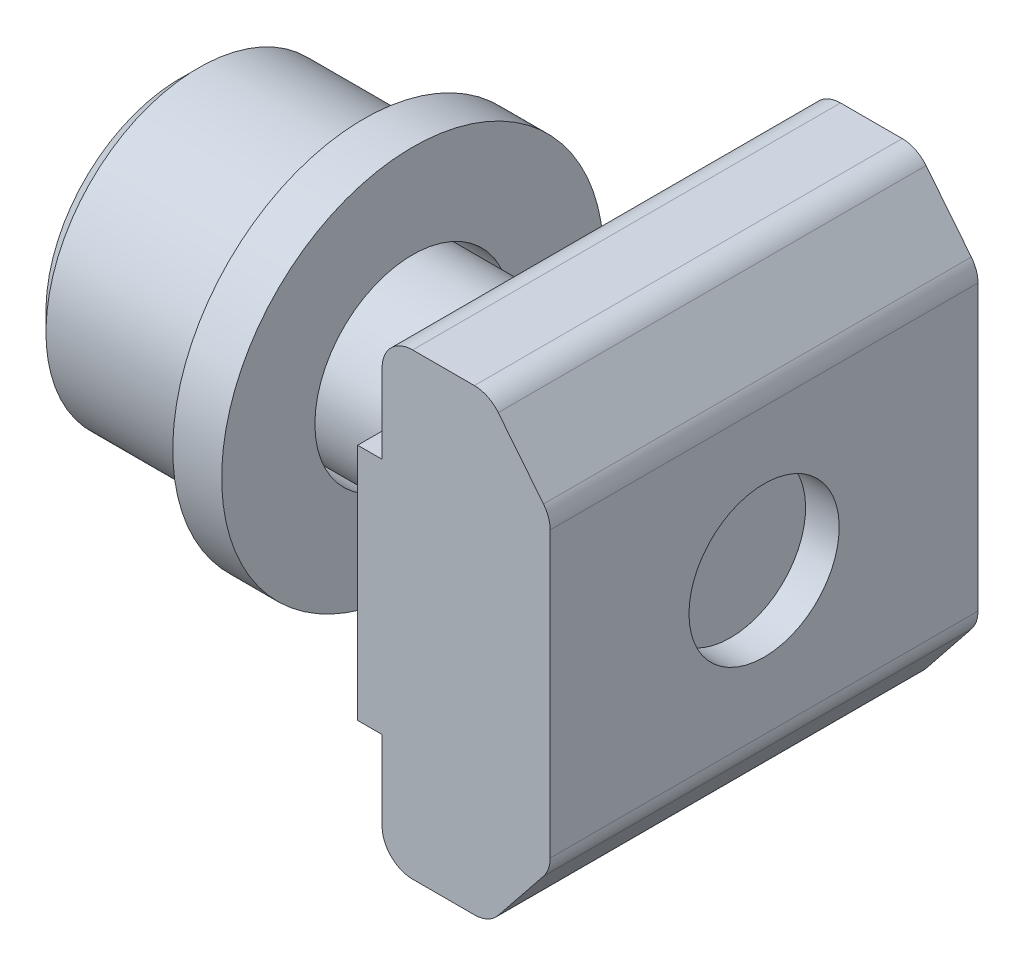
ISO-10303-21;
HEADER;
FILE_DESCRIPTION(('STEP AP214'),'2;1');
FILE_NAME('part.step','',(''),(''),'','','');
FILE_SCHEMA(('AUTOMOTIVE_DESIGN { 1 0 10303 214 1 1 1 1 }'));
ENDSEC;
DATA;
#1=APPLICATION_CONTEXT('core data for automotive mechanical design processes');
#2=APPLICATION_PROTOCOL_DEFINITION('international standard','automotive_design',2000,#1);
#3=PRODUCT_CONTEXT('',#1,'mechanical');
#4=PRODUCT('Part','Part','',(#3));
#5=PRODUCT_RELATED_PRODUCT_CATEGORY('part','',(#4));
#6=PRODUCT_DEFINITION_FORMATION('','',#4);
#7=PRODUCT_DEFINITION_CONTEXT('part definition',#1,'design');
#8=PRODUCT_DEFINITION('design','',#6,#7);
#9=PRODUCT_DEFINITION_SHAPE('','',#8);
#10=(LENGTH_UNIT() NAMED_UNIT(*) SI_UNIT(.MILLI.,.METRE.));
#11=(NAMED_UNIT(*) PLANE_ANGLE_UNIT() SI_UNIT($,.RADIAN.));
#12=(NAMED_UNIT(*) SI_UNIT($,.STERADIAN.) SOLID_ANGLE_UNIT());
#13=UNCERTAINTY_MEASURE_WITH_UNIT(LENGTH_MEASURE(1.E-05),#10,'distance_accuracy_value','');
#14=(GEOMETRIC_REPRESENTATION_CONTEXT(3) GLOBAL_UNCERTAINTY_ASSIGNED_CONTEXT((#13)) GLOBAL_UNIT_ASSIGNED_CONTEXT((#10,
#11,#12)) REPRESENTATION_CONTEXT('',''));
#15=CARTESIAN_POINT('',(0.,0.,0.));
#16=DIRECTION('',(0.,0.,1.));
#17=DIRECTION('',(1.,0.,0.));
#18=AXIS2_PLACEMENT_3D('',#15,#16,#17);
#19=CARTESIAN_POINT('',(10.5,-4.64921894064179,7.));
#20=DIRECTION('',(0.,0.,-1.));
#21=DIRECTION('',(-1.,0.,0.));
#22=AXIS2_PLACEMENT_3D('',#19,#20,#21);
#23=CYLINDRICAL_SURFACE('',#22,1.);
#24=CARTESIAN_POINT('',(10.5,-4.64921894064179,-7.));
#25=DIRECTION('',(0.,0.,1.));
#26=DIRECTION('',(1.,0.,0.));
#27=AXIS2_PLACEMENT_3D('',#24,#25,#26);
#28=CIRCLE('',#27,1.);
#29=CARTESIAN_POINT('',(11.280868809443,-5.27391398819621,-7.));
#30=VERTEX_POINT('',#29);
#31=CARTESIAN_POINT('',(11.5,-4.64921894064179,-7.));
#32=VERTEX_POINT('',#31);
#33=EDGE_CURVE('E189',#30,#32,#28,.T.);
#34=ORIENTED_EDGE('',*,*,#33,.T.);
#35=DIRECTION('',(0.,0.,-1.));
#36=VECTOR('',#35,1.);
#37=CARTESIAN_POINT('',(11.5,-4.64921894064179,7.));
#38=LINE('',#37,#36);
#39=CARTESIAN_POINT('',(11.5,-4.64921894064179,7.));
#40=VERTEX_POINT('',#39);
#41=EDGE_CURVE('E12',#40,#32,#38,.T.);
#42=ORIENTED_EDGE('',*,*,#41,.F.);
#43=CARTESIAN_POINT('',(10.5,-4.64921894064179,7.));
#44=DIRECTION('',(0.,0.,1.));
#45=DIRECTION('',(1.,0.,0.));
#46=AXIS2_PLACEMENT_3D('',#43,#44,#45);
#47=CIRCLE('',#46,1.);
#48=CARTESIAN_POINT('',(11.280868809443,-5.27391398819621,7.));
#49=VERTEX_POINT('',#48);
#50=EDGE_CURVE('E220',#49,#40,#47,.T.);
#51=ORIENTED_EDGE('',*,*,#50,.F.);
#52=DIRECTION('',(0.,0.,-1.));
#53=VECTOR('',#52,1.);
#54=CARTESIAN_POINT('',(11.280868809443,-5.27391398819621,7.));
#55=LINE('',#54,#53);
#56=EDGE_CURVE('E185',#49,#30,#55,.T.);
#57=ORIENTED_EDGE('',*,*,#56,.T.);
#58=EDGE_LOOP('',(#34,#42,#51,#57));
#59=FACE_BOUND('',#58,.T.);
#60=ADVANCED_FACE('F45',(#59),#23,.T.);
#61=CARTESIAN_POINT('',(11.5,-4.64921894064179,7.));
#62=DIRECTION('',(-1.,0.,0.));
#63=DIRECTION('',(0.,-1.,0.));
#64=AXIS2_PLACEMENT_3D('',#61,#62,#63);
#65=PLANE('',#64);
#66=CARTESIAN_POINT('',(11.5,0.,0.));
#67=DIRECTION('',(-1.,0.,0.));
#68=DIRECTION('',(0.,-1.,0.));
#69=AXIS2_PLACEMENT_3D('',#66,#67,#68);
#70=CIRCLE('',#69,2.4585);
#71=CARTESIAN_POINT('',(11.5,-2.4585,0.));
#72=VERTEX_POINT('',#71);
#73=EDGE_CURVE('E193',#72,#72,#70,.T.);
#74=ORIENTED_EDGE('',*,*,#73,.T.);
#75=EDGE_LOOP('',(#74));
#76=FACE_BOUND('',#75,.T.);
#77=DIRECTION('',(0.,1.,0.));
#78=VECTOR('',#77,1.);
#79=CARTESIAN_POINT('',(11.5,-4.64921894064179,-7.));
#80=LINE('',#79,#78);
#81=CARTESIAN_POINT('',(11.5,4.64921894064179,-7.));
#82=VERTEX_POINT('',#81);
#83=EDGE_CURVE('E192',#32,#82,#80,.T.);
#84=ORIENTED_EDGE('',*,*,#83,.T.);
#85=DIRECTION('',(0.,0.,-1.));
#86=VECTOR('',#85,1.);
#87=CARTESIAN_POINT('',(11.5,4.64921894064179,7.));
#88=LINE('',#87,#86);
#89=CARTESIAN_POINT('',(11.5,4.64921894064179,7.));
#90=VERTEX_POINT('',#89);
#91=EDGE_CURVE('E53',#90,#82,#88,.T.);
#92=ORIENTED_EDGE('',*,*,#91,.F.);
#93=DIRECTION('',(0.,1.,0.));
#94=VECTOR('',#93,1.);
#95=CARTESIAN_POINT('',(11.5,-4.64921894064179,7.));
#96=LINE('',#95,#94);
#97=EDGE_CURVE('E128',#40,#90,#96,.T.);
#98=ORIENTED_EDGE('',*,*,#97,.F.);
#99=ORIENTED_EDGE('',*,*,#41,.T.);
#100=EDGE_LOOP('',(#84,#92,#98,#99));
#101=FACE_BOUND('',#100,.T.);
#102=ADVANCED_FACE('F318',(#76,#101),#65,.F.);
#103=CARTESIAN_POINT('',(10.5,4.64921894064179,7.));
#104=DIRECTION('',(0.,0.,-1.));
#105=DIRECTION('',(-1.,0.,0.));
#106=AXIS2_PLACEMENT_3D('',#103,#104,#105);
#107=CYLINDRICAL_SURFACE('',#106,1.);
#108=CARTESIAN_POINT('',(10.5,4.64921894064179,-7.));
#109=DIRECTION('',(0.,0.,1.));
#110=DIRECTION('',(1.,0.,0.));
#111=AXIS2_PLACEMENT_3D('',#108,#109,#110);
#112=CIRCLE('',#111,1.);
#113=CARTESIAN_POINT('',(11.280868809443,5.27391398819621,-7.));
#114=VERTEX_POINT('',#113);
#115=EDGE_CURVE('E195',#82,#114,#112,.T.);
#116=ORIENTED_EDGE('',*,*,#115,.T.);
#117=DIRECTION('',(0.,0.,-1.));
#118=VECTOR('',#117,1.);
#119=CARTESIAN_POINT('',(11.280868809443,5.27391398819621,7.));
#120=LINE('',#119,#118);
#121=CARTESIAN_POINT('',(11.280868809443,5.27391398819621,7.));
#122=VERTEX_POINT('',#121);
#123=EDGE_CURVE('E251',#122,#114,#120,.T.);
#124=ORIENTED_EDGE('',*,*,#123,.F.);
#125=CARTESIAN_POINT('',(10.5,4.64921894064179,7.));
#126=DIRECTION('',(0.,0.,1.));
#127=DIRECTION('',(1.,0.,0.));
#128=AXIS2_PLACEMENT_3D('',#125,#126,#127);
#129=CIRCLE('',#128,1.);
#130=EDGE_CURVE('E259',#90,#122,#129,.T.);
#131=ORIENTED_EDGE('',*,*,#130,.F.);
#132=ORIENTED_EDGE('',*,*,#91,.T.);
#133=EDGE_LOOP('',(#116,#124,#131,#132));
#134=FACE_BOUND('',#133,.T.);
#135=ADVANCED_FACE('F257',(#134),#107,.T.);
#136=CARTESIAN_POINT('',(11.280868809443,5.27391398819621,7.));
#137=DIRECTION('',(-0.780868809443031,-0.624695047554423,0.));
#138=DIRECTION('',(0.624695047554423,-0.780868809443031,0.));
#139=AXIS2_PLACEMENT_3D('',#136,#137,#138);
#140=PLANE('',#139);
#141=DIRECTION('',(-0.624695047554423,0.780868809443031,0.));
#142=VECTOR('',#141,1.);
#143=CARTESIAN_POINT('',(11.280868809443,5.27391398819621,-7.));
#144=LINE('',#143,#142);
#145=CARTESIAN_POINT('',(9.80024396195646,7.12469504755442,-7.));
#146=VERTEX_POINT('',#145);
#147=EDGE_CURVE('E197',#114,#146,#144,.T.);
#148=ORIENTED_EDGE('',*,*,#147,.T.);
#149=DIRECTION('',(0.,0.,-1.));
#150=VECTOR('',#149,1.);
#151=CARTESIAN_POINT('',(9.80024396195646,7.12469504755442,7.));
#152=LINE('',#151,#150);
#153=CARTESIAN_POINT('',(9.80024396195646,7.12469504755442,7.));
#154=VERTEX_POINT('',#153);
#155=EDGE_CURVE('E248',#154,#146,#152,.T.);
#156=ORIENTED_EDGE('',*,*,#155,.F.);
#157=DIRECTION('',(-0.624695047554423,0.780868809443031,0.));
#158=VECTOR('',#157,1.);
#159=CARTESIAN_POINT('',(11.280868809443,5.27391398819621,7.));
#160=LINE('',#159,#158);
#161=EDGE_CURVE('E277',#122,#154,#160,.T.);
#162=ORIENTED_EDGE('',*,*,#161,.F.);
#163=ORIENTED_EDGE('',*,*,#123,.T.);
#164=EDGE_LOOP('',(#148,#156,#162,#163));
#165=FACE_BOUND('',#164,.T.);
#166=ADVANCED_FACE('F268',(#165),#140,.F.);
#167=CARTESIAN_POINT('',(9.01937515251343,6.5,7.));
#168=DIRECTION('',(0.,0.,-1.));
#169=DIRECTION('',(-1.,0.,0.));
#170=AXIS2_PLACEMENT_3D('',#167,#168,#169);
#171=CYLINDRICAL_SURFACE('',#170,1.);
#172=CARTESIAN_POINT('',(9.01937515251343,6.5,-7.));
#173=DIRECTION('',(0.,0.,1.));
#174=DIRECTION('',(1.,0.,0.));
#175=AXIS2_PLACEMENT_3D('',#172,#173,#174);
#176=CIRCLE('',#175,1.);
#177=CARTESIAN_POINT('',(9.01937515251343,7.5,-7.));
#178=VERTEX_POINT('',#177);
#179=EDGE_CURVE('E199',#146,#178,#176,.T.);
#180=ORIENTED_EDGE('',*,*,#179,.T.);
#181=DIRECTION('',(0.,0.,-1.));
#182=VECTOR('',#181,1.);
#183=CARTESIAN_POINT('',(9.01937515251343,7.5,7.));
#184=LINE('',#183,#182);
#185=CARTESIAN_POINT('',(9.01937515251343,7.5,7.));
#186=VERTEX_POINT('',#185);
#187=EDGE_CURVE('E245',#186,#178,#184,.T.);
#188=ORIENTED_EDGE('',*,*,#187,.F.);
#189=CARTESIAN_POINT('',(9.01937515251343,6.5,7.));
#190=DIRECTION('',(0.,0.,1.));
#191=DIRECTION('',(1.,0.,0.));
#192=AXIS2_PLACEMENT_3D('',#189,#190,#191);
#193=CIRCLE('',#192,1.);
#194=EDGE_CURVE('E274',#154,#186,#193,.T.);
#195=ORIENTED_EDGE('',*,*,#194,.F.);
#196=ORIENTED_EDGE('',*,*,#155,.T.);
#197=EDGE_LOOP('',(#180,#188,#195,#196));
#198=FACE_BOUND('',#197,.T.);
#199=ADVANCED_FACE('F272',(#198),#171,.T.);
#200=CARTESIAN_POINT('',(9.01937515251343,7.5,7.));
#201=DIRECTION('',(0.,-1.,0.));
#202=DIRECTION('',(0.,0.,-1.));
#203=AXIS2_PLACEMENT_3D('',#200,#201,#202);
#204=PLANE('',#203);
#205=DIRECTION('',(-1.,0.,0.));
#206=VECTOR('',#205,1.);
#207=CARTESIAN_POINT('',(9.01937515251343,7.5,-7.));
#208=LINE('',#207,#206);
#209=CARTESIAN_POINT('',(7.,7.5,-7.));
#210=VERTEX_POINT('',#209);
#211=EDGE_CURVE('E201',#178,#210,#208,.T.);
#212=ORIENTED_EDGE('',*,*,#211,.T.);
#213=DIRECTION('',(0.,0.,-1.));
#214=VECTOR('',#213,1.);
#215=CARTESIAN_POINT('',(7.,7.5,7.));
#216=LINE('',#215,#214);
#217=CARTESIAN_POINT('',(7.,7.5,7.));
#218=VERTEX_POINT('',#217);
#219=EDGE_CURVE('E242',#218,#210,#216,.T.);
#220=ORIENTED_EDGE('',*,*,#219,.F.);
#221=DIRECTION('',(-1.,0.,0.));
#222=VECTOR('',#221,1.);
#223=CARTESIAN_POINT('',(9.01937515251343,7.5,7.));
#224=LINE('',#223,#222);
#225=EDGE_CURVE('E276',#186,#218,#224,.T.);
#226=ORIENTED_EDGE('',*,*,#225,.F.);
#227=ORIENTED_EDGE('',*,*,#187,.T.);
#228=EDGE_LOOP('',(#212,#220,#226,#227));
#229=FACE_BOUND('',#228,.T.);
#230=ADVANCED_FACE('F333',(#229),#204,.F.);
#231=CARTESIAN_POINT('',(7.,6.5,7.));
#232=DIRECTION('',(0.,0.,-1.));
#233=DIRECTION('',(-1.,0.,0.));
#234=AXIS2_PLACEMENT_3D('',#231,#232,#233);
#235=CYLINDRICAL_SURFACE('',#234,1.);
#236=CARTESIAN_POINT('',(7.,6.5,-7.));
#237=DIRECTION('',(0.,0.,1.));
#238=DIRECTION('',(1.,0.,0.));
#239=AXIS2_PLACEMENT_3D('',#236,#237,#238);
#240=CIRCLE('',#239,1.);
#241=CARTESIAN_POINT('',(6.,6.5,-7.));
#242=VERTEX_POINT('',#241);
#243=EDGE_CURVE('E203',#210,#242,#240,.T.);
#244=ORIENTED_EDGE('',*,*,#243,.T.);
#245=DIRECTION('',(0.,0.,-1.));
#246=VECTOR('',#245,1.);
#247=CARTESIAN_POINT('',(6.,6.5,7.));
#248=LINE('',#247,#246);
#249=CARTESIAN_POINT('',(6.,6.5,7.));
#250=VERTEX_POINT('',#249);
#251=EDGE_CURVE('E239',#250,#242,#248,.T.);
#252=ORIENTED_EDGE('',*,*,#251,.F.);
#253=CARTESIAN_POINT('',(7.,6.5,7.));
#254=DIRECTION('',(0.,0.,1.));
#255=DIRECTION('',(1.,0.,0.));
#256=AXIS2_PLACEMENT_3D('',#253,#254,#255);
#257=CIRCLE('',#256,1.);
#258=EDGE_CURVE('E279',#218,#250,#257,.T.);
#259=ORIENTED_EDGE('',*,*,#258,.F.);
#260=ORIENTED_EDGE('',*,*,#219,.T.);
#261=EDGE_LOOP('',(#244,#252,#259,#260));
#262=FACE_BOUND('',#261,.T.);
#263=ADVANCED_FACE('F336',(#262),#235,.T.);
#264=CARTESIAN_POINT('',(6.,6.5,7.));
#265=DIRECTION('',(1.,0.,0.));
#266=DIRECTION('',(0.,1.,0.));
#267=AXIS2_PLACEMENT_3D('',#264,#265,#266);
#268=PLANE('',#267);
#269=DIRECTION('',(0.,-1.,0.));
#270=VECTOR('',#269,1.);
#271=CARTESIAN_POINT('',(6.,6.5,-7.));
#272=LINE('',#271,#270);
#273=CARTESIAN_POINT('',(6.,3.9,-7.));
#274=VERTEX_POINT('',#273);
#275=EDGE_CURVE('E205',#242,#274,#272,.T.);
#276=ORIENTED_EDGE('',*,*,#275,.T.);
#277=DIRECTION('',(0.,0.,-1.));
#278=VECTOR('',#277,1.);
#279=CARTESIAN_POINT('',(6.,3.9,7.));
#280=LINE('',#279,#278);
#281=CARTESIAN_POINT('',(6.,3.9,7.));
#282=VERTEX_POINT('',#281);
#283=EDGE_CURVE('E236',#282,#274,#280,.T.);
#284=ORIENTED_EDGE('',*,*,#283,.F.);
#285=DIRECTION('',(0.,-1.,0.));
#286=VECTOR('',#285,1.);
#287=CARTESIAN_POINT('',(6.,6.5,7.));
#288=LINE('',#287,#286);
#289=EDGE_CURVE('E285',#250,#282,#288,.T.);
#290=ORIENTED_EDGE('',*,*,#289,.F.);
#291=ORIENTED_EDGE('',*,*,#251,.T.);
#292=EDGE_LOOP('',(#276,#284,#290,#291));
#293=FACE_BOUND('',#292,.T.);
#294=ADVANCED_FACE('F340',(#293),#268,.F.);
#295=CARTESIAN_POINT('',(6.,3.9,7.));
#296=DIRECTION('',(0.,-1.,0.));
#297=DIRECTION('',(1.,0.,0.));
#298=AXIS2_PLACEMENT_3D('',#295,#296,#297);
#299=PLANE('',#298);
#300=DIRECTION('',(-1.,0.,0.));
#301=VECTOR('',#300,1.);
#302=CARTESIAN_POINT('',(6.,3.9,-7.));
#303=LINE('',#302,#301);
#304=CARTESIAN_POINT('',(5.2,3.9,-7.));
#305=VERTEX_POINT('',#304);
#306=EDGE_CURVE('E207',#274,#305,#303,.T.);
#307=ORIENTED_EDGE('',*,*,#306,.T.);
#308=DIRECTION('',(0.,0.,-1.));
#309=VECTOR('',#308,1.);
#310=CARTESIAN_POINT('',(5.2,3.9,7.));
#311=LINE('',#310,#309);
#312=CARTESIAN_POINT('',(5.2,3.9,7.));
#313=VERTEX_POINT('',#312);
#314=EDGE_CURVE('E233',#313,#305,#311,.T.);
#315=ORIENTED_EDGE('',*,*,#314,.F.);
#316=DIRECTION('',(-1.,0.,0.));
#317=VECTOR('',#316,1.);
#318=CARTESIAN_POINT('',(6.,3.9,7.));
#319=LINE('',#318,#317);
#320=EDGE_CURVE('E287',#282,#313,#319,.T.);
#321=ORIENTED_EDGE('',*,*,#320,.F.);
#322=ORIENTED_EDGE('',*,*,#283,.T.);
#323=EDGE_LOOP('',(#307,#315,#321,#322));
#324=FACE_BOUND('',#323,.T.);
#325=ADVANCED_FACE('F344',(#324),#299,.F.);
#326=CARTESIAN_POINT('',(5.2,3.9,7.));
#327=DIRECTION('',(1.,0.,0.));
#328=DIRECTION('',(0.,1.,0.));
#329=AXIS2_PLACEMENT_3D('',#326,#327,#328);
#330=PLANE('',#329);
#331=CARTESIAN_POINT('',(5.2,0.,0.));
#332=DIRECTION('',(-1.,0.,0.));
#333=DIRECTION('',(0.,0.,1.));
#334=AXIS2_PLACEMENT_3D('',#331,#332,#333);
#335=CIRCLE('',#334,2.4585);
#336=CARTESIAN_POINT('',(5.2,0.,2.4585));
#337=VERTEX_POINT('',#336);
#338=EDGE_CURVE('E434',#337,#337,#335,.T.);
#339=ORIENTED_EDGE('',*,*,#338,.F.);
#340=EDGE_LOOP('',(#339));
#341=FACE_BOUND('',#340,.T.);
#342=DIRECTION('',(0.,-1.,0.));
#343=VECTOR('',#342,1.);
#344=CARTESIAN_POINT('',(5.2,3.9,-7.));
#345=LINE('',#344,#343);
#346=CARTESIAN_POINT('',(5.2,-3.9,-7.));
#347=VERTEX_POINT('',#346);
#348=EDGE_CURVE('E209',#305,#347,#345,.T.);
#349=ORIENTED_EDGE('',*,*,#348,.T.);
#350=DIRECTION('',(0.,0.,-1.));
#351=VECTOR('',#350,1.);
#352=CARTESIAN_POINT('',(5.2,-3.9,7.));
#353=LINE('',#352,#351);
#354=CARTESIAN_POINT('',(5.2,-3.9,7.));
#355=VERTEX_POINT('',#354);
#356=EDGE_CURVE('E230',#355,#347,#353,.T.);
#357=ORIENTED_EDGE('',*,*,#356,.F.);
#358=DIRECTION('',(0.,-1.,0.));
#359=VECTOR('',#358,1.);
#360=CARTESIAN_POINT('',(5.2,3.9,7.));
#361=LINE('',#360,#359);
#362=EDGE_CURVE('E289',#313,#355,#361,.T.);
#363=ORIENTED_EDGE('',*,*,#362,.F.);
#364=ORIENTED_EDGE('',*,*,#314,.T.);
#365=EDGE_LOOP('',(#349,#357,#363,#364));
#366=FACE_BOUND('',#365,.T.);
#367=ADVANCED_FACE('F348',(#341,#366),#330,.F.);
#368=CARTESIAN_POINT('',(5.2,-3.9,7.));
#369=DIRECTION('',(0.,1.,0.));
#370=DIRECTION('',(-1.,0.,0.));
#371=AXIS2_PLACEMENT_3D('',#368,#369,#370);
#372=PLANE('',#371);
#373=DIRECTION('',(1.,0.,0.));
#374=VECTOR('',#373,1.);
#375=CARTESIAN_POINT('',(5.2,-3.9,-7.));
#376=LINE('',#375,#374);
#377=CARTESIAN_POINT('',(6.,-3.9,-7.));
#378=VERTEX_POINT('',#377);
#379=EDGE_CURVE('E211',#347,#378,#376,.T.);
#380=ORIENTED_EDGE('',*,*,#379,.T.);
#381=DIRECTION('',(0.,0.,-1.));
#382=VECTOR('',#381,1.);
#383=CARTESIAN_POINT('',(6.,-3.9,7.));
#384=LINE('',#383,#382);
#385=CARTESIAN_POINT('',(6.,-3.9,7.));
#386=VERTEX_POINT('',#385);
#387=EDGE_CURVE('E227',#386,#378,#384,.T.);
#388=ORIENTED_EDGE('',*,*,#387,.F.);
#389=DIRECTION('',(1.,0.,0.));
#390=VECTOR('',#389,1.);
#391=CARTESIAN_POINT('',(5.2,-3.9,7.));
#392=LINE('',#391,#390);
#393=EDGE_CURVE('E291',#355,#386,#392,.T.);
#394=ORIENTED_EDGE('',*,*,#393,.F.);
#395=ORIENTED_EDGE('',*,*,#356,.T.);
#396=EDGE_LOOP('',(#380,#388,#394,#395));
#397=FACE_BOUND('',#396,.T.);
#398=ADVANCED_FACE('F352',(#397),#372,.F.);
#399=CARTESIAN_POINT('',(6.,-3.9,7.));
#400=DIRECTION('',(1.,0.,0.));
#401=DIRECTION('',(0.,0.,-1.));
#402=AXIS2_PLACEMENT_3D('',#399,#400,#401);
#403=PLANE('',#402);
#404=DIRECTION('',(0.,-1.,0.));
#405=VECTOR('',#404,1.);
#406=CARTESIAN_POINT('',(6.,-3.9,-7.));
#407=LINE('',#406,#405);
#408=CARTESIAN_POINT('',(6.,-6.5,-7.));
#409=VERTEX_POINT('',#408);
#410=EDGE_CURVE('E213',#378,#409,#407,.T.);
#411=ORIENTED_EDGE('',*,*,#410,.T.);
#412=DIRECTION('',(0.,0.,-1.));
#413=VECTOR('',#412,1.);
#414=CARTESIAN_POINT('',(6.,-6.5,7.));
#415=LINE('',#414,#413);
#416=CARTESIAN_POINT('',(6.,-6.5,7.));
#417=VERTEX_POINT('',#416);
#418=EDGE_CURVE('E224',#417,#409,#415,.T.);
#419=ORIENTED_EDGE('',*,*,#418,.F.);
#420=DIRECTION('',(0.,-1.,0.));
#421=VECTOR('',#420,1.);
#422=CARTESIAN_POINT('',(6.,-3.9,7.));
#423=LINE('',#422,#421);
#424=EDGE_CURVE('E293',#386,#417,#423,.T.);
#425=ORIENTED_EDGE('',*,*,#424,.F.);
#426=ORIENTED_EDGE('',*,*,#387,.T.);
#427=EDGE_LOOP('',(#411,#419,#425,#426));
#428=FACE_BOUND('',#427,.T.);
#429=ADVANCED_FACE('F299',(#428),#403,.F.);
#430=CARTESIAN_POINT('',(7.,-6.5,7.));
#431=DIRECTION('',(0.,0.,-1.));
#432=DIRECTION('',(-1.,0.,0.));
#433=AXIS2_PLACEMENT_3D('',#430,#431,#432);
#434=CYLINDRICAL_SURFACE('',#433,1.);
#435=CARTESIAN_POINT('',(7.,-6.5,-7.));
#436=DIRECTION('',(0.,0.,1.));
#437=DIRECTION('',(1.,0.,0.));
#438=AXIS2_PLACEMENT_3D('',#435,#436,#437);
#439=CIRCLE('',#438,1.);
#440=CARTESIAN_POINT('',(7.,-7.5,-7.));
#441=VERTEX_POINT('',#440);
#442=EDGE_CURVE('E215',#409,#441,#439,.T.);
#443=ORIENTED_EDGE('',*,*,#442,.T.);
#444=DIRECTION('',(0.,0.,-1.));
#445=VECTOR('',#444,1.);
#446=CARTESIAN_POINT('',(7.,-7.5,7.));
#447=LINE('',#446,#445);
#448=CARTESIAN_POINT('',(7.,-7.5,7.));
#449=VERTEX_POINT('',#448);
#450=EDGE_CURVE('E180',#449,#441,#447,.T.);
#451=ORIENTED_EDGE('',*,*,#450,.F.);
#452=CARTESIAN_POINT('',(7.,-6.5,7.));
#453=DIRECTION('',(0.,0.,1.));
#454=DIRECTION('',(1.,0.,0.));
#455=AXIS2_PLACEMENT_3D('',#452,#453,#454);
#456=CIRCLE('',#455,1.);
#457=EDGE_CURVE('E171',#417,#449,#456,.T.);
#458=ORIENTED_EDGE('',*,*,#457,.F.);
#459=ORIENTED_EDGE('',*,*,#418,.T.);
#460=EDGE_LOOP('',(#443,#451,#458,#459));
#461=FACE_BOUND('',#460,.T.);
#462=ADVANCED_FACE('F303',(#461),#434,.T.);
#463=CARTESIAN_POINT('',(7.,-7.5,7.));
#464=DIRECTION('',(0.,1.,0.));
#465=DIRECTION('',(0.,0.,1.));
#466=AXIS2_PLACEMENT_3D('',#463,#464,#465);
#467=PLANE('',#466);
#468=DIRECTION('',(1.,0.,0.));
#469=VECTOR('',#468,1.);
#470=CARTESIAN_POINT('',(7.,-7.5,-7.));
#471=LINE('',#470,#469);
#472=CARTESIAN_POINT('',(9.01937515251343,-7.5,-7.));
#473=VERTEX_POINT('',#472);
#474=EDGE_CURVE('E179',#441,#473,#471,.T.);
#475=ORIENTED_EDGE('',*,*,#474,.T.);
#476=DIRECTION('',(0.,0.,-1.));
#477=VECTOR('',#476,1.);
#478=CARTESIAN_POINT('',(9.01937515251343,-7.5,7.));
#479=LINE('',#478,#477);
#480=CARTESIAN_POINT('',(9.01937515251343,-7.5,7.));
#481=VERTEX_POINT('',#480);
#482=EDGE_CURVE('E176',#481,#473,#479,.T.);
#483=ORIENTED_EDGE('',*,*,#482,.F.);
#484=DIRECTION('',(1.,0.,0.));
#485=VECTOR('',#484,1.);
#486=CARTESIAN_POINT('',(7.,-7.5,7.));
#487=LINE('',#486,#485);
#488=EDGE_CURVE('E165',#449,#481,#487,.T.);
#489=ORIENTED_EDGE('',*,*,#488,.F.);
#490=ORIENTED_EDGE('',*,*,#450,.T.);
#491=EDGE_LOOP('',(#475,#483,#489,#490));
#492=FACE_BOUND('',#491,.T.);
#493=ADVANCED_FACE('F177',(#492),#467,.F.);
#494=CARTESIAN_POINT('',(9.01937515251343,-6.5,7.));
#495=DIRECTION('',(0.,0.,-1.));
#496=DIRECTION('',(-1.,0.,0.));
#497=AXIS2_PLACEMENT_3D('',#494,#495,#496);
#498=CYLINDRICAL_SURFACE('',#497,1.);
#499=CARTESIAN_POINT('',(9.01937515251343,-6.5,-7.));
#500=DIRECTION('',(0.,0.,1.));
#501=DIRECTION('',(1.,0.,0.));
#502=AXIS2_PLACEMENT_3D('',#499,#500,#501);
#503=CIRCLE('',#502,1.);
#504=CARTESIAN_POINT('',(9.80024396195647,-7.12469504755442,-7.));
#505=VERTEX_POINT('',#504);
#506=EDGE_CURVE('E114',#473,#505,#503,.T.);
#507=ORIENTED_EDGE('',*,*,#506,.T.);
#508=DIRECTION('',(0.,0.,-1.));
#509=VECTOR('',#508,1.);
#510=CARTESIAN_POINT('',(9.80024396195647,-7.12469504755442,7.));
#511=LINE('',#510,#509);
#512=CARTESIAN_POINT('',(9.80024396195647,-7.12469504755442,7.));
#513=VERTEX_POINT('',#512);
#514=EDGE_CURVE('E181',#513,#505,#511,.T.);
#515=ORIENTED_EDGE('',*,*,#514,.F.);
#516=CARTESIAN_POINT('',(9.01937515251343,-6.5,7.));
#517=DIRECTION('',(0.,0.,1.));
#518=DIRECTION('',(1.,0.,0.));
#519=AXIS2_PLACEMENT_3D('',#516,#517,#518);
#520=CIRCLE('',#519,1.);
#521=EDGE_CURVE('E169',#481,#513,#520,.T.);
#522=ORIENTED_EDGE('',*,*,#521,.F.);
#523=ORIENTED_EDGE('',*,*,#482,.T.);
#524=EDGE_LOOP('',(#507,#515,#522,#523));
#525=FACE_BOUND('',#524,.T.);
#526=ADVANCED_FACE('F183',(#525),#498,.T.);
#527=CARTESIAN_POINT('',(9.80024396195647,-7.12469504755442,7.));
#528=DIRECTION('',(-0.780868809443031,0.624695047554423,0.));
#529=DIRECTION('',(-0.624695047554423,-0.780868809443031,0.));
#530=AXIS2_PLACEMENT_3D('',#527,#528,#529);
#531=PLANE('',#530);
#532=DIRECTION('',(0.624695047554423,0.780868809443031,0.));
#533=VECTOR('',#532,1.);
#534=CARTESIAN_POINT('',(9.80024396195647,-7.12469504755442,-7.));
#535=LINE('',#534,#533);
#536=EDGE_CURVE('E120',#505,#30,#535,.T.);
#537=ORIENTED_EDGE('',*,*,#536,.T.);
#538=ORIENTED_EDGE('',*,*,#56,.F.);
#539=DIRECTION('',(0.624695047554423,0.780868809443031,0.));
#540=VECTOR('',#539,1.);
#541=CARTESIAN_POINT('',(9.80024396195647,-7.12469504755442,7.));
#542=LINE('',#541,#540);
#543=EDGE_CURVE('E61',#513,#49,#542,.T.);
#544=ORIENTED_EDGE('',*,*,#543,.F.);
#545=ORIENTED_EDGE('',*,*,#514,.T.);
#546=EDGE_LOOP('',(#537,#538,#544,#545));
#547=FACE_BOUND('',#546,.T.);
#548=ADVANCED_FACE('F307',(#547),#531,.F.);
#549=CARTESIAN_POINT('',(10.5,-4.64921894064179,7.));
#550=DIRECTION('',(0.,0.,1.));
#551=DIRECTION('',(1.,0.,0.));
#552=AXIS2_PLACEMENT_3D('',#549,#550,#551);
#553=PLANE('',#552);
#554=ORIENTED_EDGE('',*,*,#50,.T.);
#555=ORIENTED_EDGE('',*,*,#97,.T.);
#556=ORIENTED_EDGE('',*,*,#130,.T.);
#557=ORIENTED_EDGE('',*,*,#161,.T.);
#558=ORIENTED_EDGE('',*,*,#194,.T.);
#559=ORIENTED_EDGE('',*,*,#225,.T.);
#560=ORIENTED_EDGE('',*,*,#258,.T.);
#561=ORIENTED_EDGE('',*,*,#289,.T.);
#562=ORIENTED_EDGE('',*,*,#320,.T.);
#563=ORIENTED_EDGE('',*,*,#362,.T.);
#564=ORIENTED_EDGE('',*,*,#393,.T.);
#565=ORIENTED_EDGE('',*,*,#424,.T.);
#566=ORIENTED_EDGE('',*,*,#457,.T.);
#567=ORIENTED_EDGE('',*,*,#488,.T.);
#568=ORIENTED_EDGE('',*,*,#521,.T.);
#569=ORIENTED_EDGE('',*,*,#543,.T.);
#570=EDGE_LOOP('',(#554,#555,#556,#557,#558,#559,#560,#561,#562,#563,#564,#565,#566,#567,#568,#569));
#571=FACE_BOUND('',#570,.T.);
#572=ADVANCED_FACE('F167',(#571),#553,.T.);
#573=CARTESIAN_POINT('',(10.5,-4.64921894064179,-7.));
#574=DIRECTION('',(0.,0.,1.));
#575=DIRECTION('',(1.,0.,0.));
#576=AXIS2_PLACEMENT_3D('',#573,#574,#575);
#577=PLANE('',#576);
#578=ORIENTED_EDGE('',*,*,#33,.F.);
#579=ORIENTED_EDGE('',*,*,#536,.F.);
#580=ORIENTED_EDGE('',*,*,#506,.F.);
#581=ORIENTED_EDGE('',*,*,#474,.F.);
#582=ORIENTED_EDGE('',*,*,#442,.F.);
#583=ORIENTED_EDGE('',*,*,#410,.F.);
#584=ORIENTED_EDGE('',*,*,#379,.F.);
#585=ORIENTED_EDGE('',*,*,#348,.F.);
#586=ORIENTED_EDGE('',*,*,#306,.F.);
#587=ORIENTED_EDGE('',*,*,#275,.F.);
#588=ORIENTED_EDGE('',*,*,#243,.F.);
#589=ORIENTED_EDGE('',*,*,#211,.F.);
#590=ORIENTED_EDGE('',*,*,#179,.F.);
#591=ORIENTED_EDGE('',*,*,#147,.F.);
#592=ORIENTED_EDGE('',*,*,#115,.F.);
#593=ORIENTED_EDGE('',*,*,#83,.F.);
#594=EDGE_LOOP('',(#578,#579,#580,#581,#582,#583,#584,#585,#586,#587,#588,#589,#590,#591,#592,#593));
#595=FACE_BOUND('',#594,.T.);
#596=ADVANCED_FACE('F263',(#595),#577,.F.);
#597=CARTESIAN_POINT('',(5.2,0.,0.));
#598=DIRECTION('',(-1.,0.,0.));
#599=DIRECTION('',(0.,0.,1.));
#600=AXIS2_PLACEMENT_3D('',#597,#598,#599);
#601=CYLINDRICAL_SURFACE('',#600,2.4585);
#602=ORIENTED_EDGE('',*,*,#73,.F.);
#603=EDGE_LOOP('',(#602));
#604=FACE_BOUND('',#603,.T.);
#605=ORIENTED_EDGE('',*,*,#338,.T.);
#606=EDGE_LOOP('',(#605));
#607=FACE_BOUND('',#606,.T.);
#608=ADVANCED_FACE('F388',(#604,#607),#601,.F.);
#609=CLOSED_SHELL('',(#60,#102,#135,#166,#199,#230,#263,#294,#325,#367,#398,#429,#462,#493,#526,
#548,#572,#596,#608));
#610=MANIFOLD_SOLID_BREP('B2',#609);
#611=CARTESIAN_POINT('',(-19.2776695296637,0.,0.));
#612=DIRECTION('',(1.,0.,0.));
#613=DIRECTION('',(0.,0.,-1.));
#614=AXIS2_PLACEMENT_3D('',#611,#612,#613);
#615=CYLINDRICAL_SURFACE('',#614,6.25);
#616=CARTESIAN_POINT('',(0.,0.,0.));
#617=DIRECTION('',(1.,0.,0.));
#618=DIRECTION('',(0.,0.,-1.));
#619=AXIS2_PLACEMENT_3D('',#616,#617,#618);
#620=CIRCLE('',#619,6.25);
#621=CARTESIAN_POINT('',(0.,0.,-6.25));
#622=VERTEX_POINT('',#621);
#623=EDGE_CURVE('E533',#622,#622,#620,.T.);
#624=ORIENTED_EDGE('',*,*,#623,.F.);
#625=EDGE_LOOP('',(#624));
#626=FACE_BOUND('',#625,.T.);
#627=CARTESIAN_POINT('',(-1.6,0.,0.));
#628=DIRECTION('',(-1.,0.,0.));
#629=DIRECTION('',(0.,-1.,0.));
#630=AXIS2_PLACEMENT_3D('',#627,#628,#629);
#631=CIRCLE('',#630,6.25);
#632=CARTESIAN_POINT('',(-1.6,-6.25,0.));
#633=VERTEX_POINT('',#632);
#634=EDGE_CURVE('E529',#633,#633,#631,.F.);
#635=ORIENTED_EDGE('',*,*,#634,.T.);
#636=EDGE_LOOP('',(#635));
#637=FACE_BOUND('',#636,.T.);
#638=ADVANCED_FACE('F525',(#626,#637),#615,.T.);
#639=CARTESIAN_POINT('',(-19.2776695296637,0.,0.));
#640=DIRECTION('',(1.,0.,0.));
#641=DIRECTION('',(0.,0.,-1.));
#642=AXIS2_PLACEMENT_3D('',#639,#640,#641);
#643=CYLINDRICAL_SURFACE('',#642,3.20000000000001);
#644=CARTESIAN_POINT('',(0.,0.,0.));
#645=DIRECTION('',(1.,0.,0.));
#646=DIRECTION('',(0.,0.,-1.));
#647=AXIS2_PLACEMENT_3D('',#644,#645,#646);
#648=CIRCLE('',#647,3.20000000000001);
#649=CARTESIAN_POINT('',(0.,0.,-3.20000000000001));
#650=VERTEX_POINT('',#649);
#651=EDGE_CURVE('E537',#650,#650,#648,.T.);
#652=ORIENTED_EDGE('',*,*,#651,.T.);
#653=EDGE_LOOP('',(#652));
#654=FACE_BOUND('',#653,.T.);
#655=CARTESIAN_POINT('',(-1.6,0.,0.));
#656=DIRECTION('',(-1.,0.,0.));
#657=DIRECTION('',(0.,-1.,0.));
#658=AXIS2_PLACEMENT_3D('',#655,#656,#657);
#659=CIRCLE('',#658,3.20000000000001);
#660=CARTESIAN_POINT('',(-1.6,-3.20000000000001,0.));
#661=VERTEX_POINT('',#660);
#662=EDGE_CURVE('E44',#661,#661,#659,.F.);
#663=ORIENTED_EDGE('',*,*,#662,.F.);
#664=EDGE_LOOP('',(#663));
#665=FACE_BOUND('',#664,.T.);
#666=ADVANCED_FACE('F552',(#654,#665),#643,.F.);
#667=CARTESIAN_POINT('',(0.,0.,0.));
#668=DIRECTION('',(1.,0.,0.));
#669=DIRECTION('',(0.,0.,-1.));
#670=AXIS2_PLACEMENT_3D('',#667,#668,#669);
#671=PLANE('',#670);
#672=ORIENTED_EDGE('',*,*,#651,.F.);
#673=EDGE_LOOP('',(#672));
#674=FACE_BOUND('',#673,.T.);
#675=ORIENTED_EDGE('',*,*,#623,.T.);
#676=EDGE_LOOP('',(#675));
#677=FACE_BOUND('',#676,.T.);
#678=ADVANCED_FACE('F548',(#674,#677),#671,.T.);
#679=CARTESIAN_POINT('',(-1.6,4.99999999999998,0.));
#680=DIRECTION('',(-1.,0.,0.));
#681=DIRECTION('',(0.,-1.,0.));
#682=AXIS2_PLACEMENT_3D('',#679,#680,#681);
#683=PLANE('',#682);
#684=ORIENTED_EDGE('',*,*,#634,.F.);
#685=EDGE_LOOP('',(#684));
#686=FACE_BOUND('',#685,.T.);
#687=ORIENTED_EDGE('',*,*,#662,.T.);
#688=EDGE_LOOP('',(#687));
#689=FACE_BOUND('',#688,.T.);
#690=ADVANCED_FACE('F527',(#686,#689),#683,.T.);
#691=CLOSED_SHELL('',(#638,#666,#678,#690));
#692=MANIFOLD_SOLID_BREP('B6',#691);
#693=CARTESIAN_POINT('',(10.4,0.,0.));
#694=DIRECTION('',(-1.,0.,0.));
#695=DIRECTION('',(0.,-1.,0.));
#696=AXIS2_PLACEMENT_3D('',#693,#694,#695);
#697=PLANE('',#696);
#698=CARTESIAN_POINT('',(10.4,0.,0.));
#699=DIRECTION('',(-1.,0.,0.));
#700=DIRECTION('',(0.,-1.,0.));
#701=AXIS2_PLACEMENT_3D('',#698,#699,#700);
#702=CIRCLE('',#701,3.);
#703=CARTESIAN_POINT('',(10.4,-3.,0.));
#704=VERTEX_POINT('',#703);
#705=EDGE_CURVE('E723',#704,#704,#702,.T.);
#706=ORIENTED_EDGE('',*,*,#705,.F.);
#707=EDGE_LOOP('',(#706));
#708=FACE_BOUND('',#707,.T.);
#709=ADVANCED_FACE('F586',(#708),#697,.F.);
#710=CARTESIAN_POINT('',(-3.15662432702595,0.,0.));
#711=DIRECTION('',(-1.,0.,0.));
#712=DIRECTION('',(0.,-1.,0.));
#713=AXIS2_PLACEMENT_3D('',#710,#711,#712);
#714=CYLINDRICAL_SURFACE('',#713,3.);
#715=CARTESIAN_POINT('',(-1.6,0.,0.));
#716=DIRECTION('',(-1.,0.,0.));
#717=DIRECTION('',(0.,-1.,0.));
#718=AXIS2_PLACEMENT_3D('',#715,#716,#717);
#719=CIRCLE('',#718,3.);
#720=CARTESIAN_POINT('',(-1.6,-3.,0.));
#721=VERTEX_POINT('',#720);
#722=EDGE_CURVE('E720',#721,#721,#719,.T.);
#723=ORIENTED_EDGE('',*,*,#722,.F.);
#724=EDGE_LOOP('',(#723));
#725=FACE_BOUND('',#724,.T.);
#726=ORIENTED_EDGE('',*,*,#705,.T.);
#727=EDGE_LOOP('',(#726));
#728=FACE_BOUND('',#727,.T.);
#729=ADVANCED_FACE('F786',(#725,#728),#714,.T.);
#730=CARTESIAN_POINT('',(-1.6,4.99999999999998,0.));
#731=DIRECTION('',(-1.,0.,0.));
#732=DIRECTION('',(0.,-1.,0.));
#733=AXIS2_PLACEMENT_3D('',#730,#731,#732);
#734=PLANE('',#733);
#735=CARTESIAN_POINT('',(-1.6,0.,0.));
#736=DIRECTION('',(-1.,0.,0.));
#737=DIRECTION('',(0.,-1.,0.));
#738=AXIS2_PLACEMENT_3D('',#735,#736,#737);
#739=CIRCLE('',#738,4.99999999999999);
#740=CARTESIAN_POINT('',(-1.6,-4.99999999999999,0.));
#741=VERTEX_POINT('',#740);
#742=EDGE_CURVE('E717',#741,#741,#739,.T.);
#743=ORIENTED_EDGE('',*,*,#742,.F.);
#744=EDGE_LOOP('',(#743));
#745=FACE_BOUND('',#744,.T.);
#746=ORIENTED_EDGE('',*,*,#722,.T.);
#747=EDGE_LOOP('',(#746));
#748=FACE_BOUND('',#747,.T.);
#749=ADVANCED_FACE('F791',(#745,#748),#734,.F.);
#750=CARTESIAN_POINT('',(-3.15662432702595,0.,0.));
#751=DIRECTION('',(-1.,0.,0.));
#752=DIRECTION('',(0.,-1.,0.));
#753=AXIS2_PLACEMENT_3D('',#750,#751,#752);
#754=CYLINDRICAL_SURFACE('',#753,4.99999999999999);
#755=CARTESIAN_POINT('',(-7.00000000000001,0.,0.));
#756=DIRECTION('',(-1.,0.,0.));
#757=DIRECTION('',(0.,-1.,0.));
#758=AXIS2_PLACEMENT_3D('',#755,#756,#757);
#759=CIRCLE('',#758,4.99999999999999);
#760=CARTESIAN_POINT('',(-7.00000000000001,-4.99999999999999,0.));
#761=VERTEX_POINT('',#760);
#762=EDGE_CURVE('E714',#761,#761,#759,.T.);
#763=ORIENTED_EDGE('',*,*,#762,.F.);
#764=EDGE_LOOP('',(#763));
#765=FACE_BOUND('',#764,.T.);
#766=ORIENTED_EDGE('',*,*,#742,.T.);
#767=EDGE_LOOP('',(#766));
#768=FACE_BOUND('',#767,.T.);
#769=ADVANCED_FACE('F798',(#765,#768),#754,.T.);
#770=CARTESIAN_POINT('',(-7.00000000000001,0.,0.));
#771=DIRECTION('',(1.,0.,0.));
#772=DIRECTION('',(0.,1.,0.));
#773=AXIS2_PLACEMENT_3D('',#770,#771,#772);
#774=CONICAL_SURFACE('',#773,4.99999999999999,0.785398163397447);
#775=CARTESIAN_POINT('',(-7.6,0.,0.));
#776=DIRECTION('',(-1.,0.,0.));
#777=DIRECTION('',(0.,-1.,0.));
#778=AXIS2_PLACEMENT_3D('',#775,#776,#777);
#779=CIRCLE('',#778,4.4);
#780=CARTESIAN_POINT('',(-7.6,-4.4,0.));
#781=VERTEX_POINT('',#780);
#782=EDGE_CURVE('E700',#781,#781,#779,.T.);
#783=ORIENTED_EDGE('',*,*,#782,.F.);
#784=EDGE_LOOP('',(#783));
#785=FACE_BOUND('',#784,.T.);
#786=ORIENTED_EDGE('',*,*,#762,.T.);
#787=EDGE_LOOP('',(#786));
#788=FACE_BOUND('',#787,.T.);
#789=ADVANCED_FACE('F802',(#785,#788),#774,.T.);
#790=CARTESIAN_POINT('',(-7.6,4.4,0.));
#791=DIRECTION('',(1.,0.,0.));
#792=DIRECTION('',(0.,1.,0.));
#793=AXIS2_PLACEMENT_3D('',#790,#791,#792);
#794=PLANE('',#793);
#795=DIRECTION('',(0.,0.5,0.866025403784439));
#796=VECTOR('',#795,1.);
#797=CARTESIAN_POINT('',(-7.6,3.2650635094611,0.655255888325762));
#798=LINE('',#797,#796);
#799=CARTESIAN_POINT('',(-7.6,1.44337567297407,-2.5));
#800=VERTEX_POINT('',#799);
#801=CARTESIAN_POINT('',(-7.6,2.88675134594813,0.));
#802=VERTEX_POINT('',#801);
#803=EDGE_CURVE('E608',#800,#802,#798,.T.);
#804=ORIENTED_EDGE('',*,*,#803,.T.);
#805=DIRECTION('',(0.,-0.5,0.866025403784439));
#806=VECTOR('',#805,1.);
#807=CARTESIAN_POINT('',(-7.6,3.2650635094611,-0.655255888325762));
#808=LINE('',#807,#806);
#809=CARTESIAN_POINT('',(-7.6,1.44337567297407,2.5));
#810=VERTEX_POINT('',#809);
#811=EDGE_CURVE('E523',#802,#810,#808,.T.);
#812=ORIENTED_EDGE('',*,*,#811,.T.);
#813=DIRECTION('',(0.,-1.,0.));
#814=VECTOR('',#813,1.);
#815=CARTESIAN_POINT('',(-7.6,4.4,2.5));
#816=LINE('',#815,#814);
#817=CARTESIAN_POINT('',(-7.6,-1.44337567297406,2.5));
#818=VERTEX_POINT('',#817);
#819=EDGE_CURVE('E594',#810,#818,#816,.T.);
#820=ORIENTED_EDGE('',*,*,#819,.T.);
#821=DIRECTION('',(0.,-0.5,-0.866025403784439));
#822=VECTOR('',#821,1.);
#823=CARTESIAN_POINT('',(-7.6,-1.06506350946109,3.15525588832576));
#824=LINE('',#823,#822);
#825=CARTESIAN_POINT('',(-7.6,-2.88675134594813,0.));
#826=VERTEX_POINT('',#825);
#827=EDGE_CURVE('E736',#818,#826,#824,.T.);
#828=ORIENTED_EDGE('',*,*,#827,.T.);
#829=DIRECTION('',(0.,0.5,-0.866025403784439));
#830=VECTOR('',#829,1.);
#831=CARTESIAN_POINT('',(-7.6,-1.0650635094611,-3.15525588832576));
#832=LINE('',#831,#830);
#833=CARTESIAN_POINT('',(-7.6,-1.44337567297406,-2.5));
#834=VERTEX_POINT('',#833);
#835=EDGE_CURVE('E734',#826,#834,#832,.T.);
#836=ORIENTED_EDGE('',*,*,#835,.T.);
#837=DIRECTION('',(0.,1.,0.));
#838=VECTOR('',#837,1.);
#839=CARTESIAN_POINT('',(-7.6,4.4,-2.5));
#840=LINE('',#839,#838);
#841=EDGE_CURVE('E732',#834,#800,#840,.T.);
#842=ORIENTED_EDGE('',*,*,#841,.T.);
#843=EDGE_LOOP('',(#804,#812,#820,#828,#836,#842));
#844=FACE_BOUND('',#843,.T.);
#845=ORIENTED_EDGE('',*,*,#782,.T.);
#846=EDGE_LOOP('',(#845));
#847=FACE_BOUND('',#846,.T.);
#848=ADVANCED_FACE('F739',(#844,#847),#794,.F.);
#849=CARTESIAN_POINT('',(-4.60000000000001,0.,0.));
#850=DIRECTION('',(-1.,0.,0.));
#851=DIRECTION('',(0.,0.,1.));
#852=AXIS2_PLACEMENT_3D('',#849,#850,#851);
#853=PLANE('',#852);
#854=CARTESIAN_POINT('',(-4.60000000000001,0.,0.));
#855=DIRECTION('',(-1.,0.,0.));
#856=DIRECTION('',(0.,-1.,0.));
#857=AXIS2_PLACEMENT_3D('',#854,#855,#856);
#858=CIRCLE('',#857,2.50000000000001);
#859=CARTESIAN_POINT('',(-4.60000000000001,-2.16506350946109,1.25));
#860=VERTEX_POINT('',#859);
#861=CARTESIAN_POINT('',(-4.60000000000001,0.,2.5));
#862=VERTEX_POINT('',#861);
#863=EDGE_CURVE('E727',#860,#862,#858,.T.);
#864=ORIENTED_EDGE('',*,*,#863,.F.);
#865=DIRECTION('',(0.,0.5,0.866025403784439));
#866=VECTOR('',#865,1.);
#867=CARTESIAN_POINT('',(-4.60000000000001,-2.88675134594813,0.));
#868=LINE('',#867,#866);
#869=CARTESIAN_POINT('',(-4.60000000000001,-1.44337567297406,2.5));
#870=VERTEX_POINT('',#869);
#871=EDGE_CURVE('E691',#860,#870,#868,.T.);
#872=ORIENTED_EDGE('',*,*,#871,.T.);
#873=DIRECTION('',(0.,1.,0.));
#874=VECTOR('',#873,1.);
#875=CARTESIAN_POINT('',(-4.60000000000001,-1.44337567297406,2.5));
#876=LINE('',#875,#874);
#877=EDGE_CURVE('E675',#870,#862,#876,.T.);
#878=ORIENTED_EDGE('',*,*,#877,.T.);
#879=EDGE_LOOP('',(#864,#872,#878));
#880=FACE_BOUND('',#879,.T.);
#881=ADVANCED_FACE('F754',(#880),#853,.T.);
#882=CARTESIAN_POINT('',(-4.60000000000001,-2.1650635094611,-1.25));
#883=VERTEX_POINT('',#882);
#884=EDGE_CURVE('E726',#883,#860,#858,.T.);
#885=ORIENTED_EDGE('',*,*,#884,.F.);
#886=DIRECTION('',(0.,-0.5,0.866025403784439));
#887=VECTOR('',#886,1.);
#888=CARTESIAN_POINT('',(-4.60000000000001,-1.44337567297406,-2.5));
#889=LINE('',#888,#887);
#890=CARTESIAN_POINT('',(-4.60000000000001,-2.88675134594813,0.));
#891=VERTEX_POINT('',#890);
#892=EDGE_CURVE('E687',#883,#891,#889,.T.);
#893=ORIENTED_EDGE('',*,*,#892,.T.);
#894=EDGE_CURVE('E692',#891,#860,#868,.T.);
#895=ORIENTED_EDGE('',*,*,#894,.T.);
#896=EDGE_LOOP('',(#885,#893,#895));
#897=FACE_BOUND('',#896,.T.);
#898=ADVANCED_FACE('F776',(#897),#853,.T.);
#899=CARTESIAN_POINT('',(-4.60000000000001,0.,-2.5));
#900=VERTEX_POINT('',#899);
#901=EDGE_CURVE('E759',#900,#883,#858,.T.);
#902=ORIENTED_EDGE('',*,*,#901,.F.);
#903=DIRECTION('',(0.,-1.,0.));
#904=VECTOR('',#903,1.);
#905=CARTESIAN_POINT('',(-4.60000000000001,1.44337567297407,-2.5));
#906=LINE('',#905,#904);
#907=CARTESIAN_POINT('',(-4.60000000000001,-1.44337567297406,-2.5));
#908=VERTEX_POINT('',#907);
#909=EDGE_CURVE('E681',#900,#908,#906,.T.);
#910=ORIENTED_EDGE('',*,*,#909,.T.);
#911=EDGE_CURVE('E688',#908,#883,#889,.T.);
#912=ORIENTED_EDGE('',*,*,#911,.T.);
#913=EDGE_LOOP('',(#902,#910,#912));
#914=FACE_BOUND('',#913,.T.);
#915=ADVANCED_FACE('F773',(#914),#853,.T.);
#916=CARTESIAN_POINT('',(-4.60000000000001,2.1650635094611,-1.25));
#917=VERTEX_POINT('',#916);
#918=EDGE_CURVE('E762',#917,#900,#858,.T.);
#919=ORIENTED_EDGE('',*,*,#918,.F.);
#920=DIRECTION('',(0.,-0.5,-0.866025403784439));
#921=VECTOR('',#920,1.);
#922=CARTESIAN_POINT('',(-4.60000000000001,2.88675134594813,0.));
#923=LINE('',#922,#921);
#924=CARTESIAN_POINT('',(-4.60000000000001,1.44337567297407,-2.5));
#925=VERTEX_POINT('',#924);
#926=EDGE_CURVE('E680',#917,#925,#923,.T.);
#927=ORIENTED_EDGE('',*,*,#926,.T.);
#928=EDGE_CURVE('E683',#925,#900,#906,.T.);
#929=ORIENTED_EDGE('',*,*,#928,.T.);
#930=EDGE_LOOP('',(#919,#927,#929));
#931=FACE_BOUND('',#930,.T.);
#932=ADVANCED_FACE('F764',(#931),#853,.T.);
#933=CARTESIAN_POINT('',(-4.60000000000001,2.1650635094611,1.25));
#934=VERTEX_POINT('',#933);
#935=EDGE_CURVE('E665',#934,#917,#858,.T.);
#936=ORIENTED_EDGE('',*,*,#935,.F.);
#937=DIRECTION('',(0.,0.5,-0.866025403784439));
#938=VECTOR('',#937,1.);
#939=CARTESIAN_POINT('',(-4.60000000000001,1.44337567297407,2.5));
#940=LINE('',#939,#938);
#941=CARTESIAN_POINT('',(-4.60000000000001,2.88675134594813,0.));
#942=VERTEX_POINT('',#941);
#943=EDGE_CURVE('E659',#934,#942,#940,.T.);
#944=ORIENTED_EDGE('',*,*,#943,.T.);
#945=EDGE_CURVE('E663',#942,#917,#923,.T.);
#946=ORIENTED_EDGE('',*,*,#945,.T.);
#947=EDGE_LOOP('',(#936,#944,#946));
#948=FACE_BOUND('',#947,.T.);
#949=ADVANCED_FACE('F661',(#948),#853,.T.);
#950=EDGE_CURVE('E730',#862,#934,#858,.T.);
#951=ORIENTED_EDGE('',*,*,#950,.F.);
#952=CARTESIAN_POINT('',(-4.60000000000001,1.44337567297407,2.5));
#953=VERTEX_POINT('',#952);
#954=EDGE_CURVE('E695',#862,#953,#876,.T.);
#955=ORIENTED_EDGE('',*,*,#954,.T.);
#956=EDGE_CURVE('E601',#953,#934,#940,.T.);
#957=ORIENTED_EDGE('',*,*,#956,.T.);
#958=EDGE_LOOP('',(#951,#955,#957));
#959=FACE_BOUND('',#958,.T.);
#960=ADVANCED_FACE('F783',(#959),#853,.T.);
#961=CARTESIAN_POINT('',(-4.60000000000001,1.44337567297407,2.5));
#962=DIRECTION('',(0.,0.866025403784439,0.499999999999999));
#963=DIRECTION('',(0.,-0.5,0.866025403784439));
#964=AXIS2_PLACEMENT_3D('',#961,#962,#963);
#965=PLANE('',#964);
#966=ORIENTED_EDGE('',*,*,#811,.F.);
#967=DIRECTION('',(-1.,0.,0.));
#968=VECTOR('',#967,1.);
#969=CARTESIAN_POINT('',(-4.60000000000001,2.88675134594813,0.));
#970=LINE('',#969,#968);
#971=EDGE_CURVE('E670',#942,#802,#970,.T.);
#972=ORIENTED_EDGE('',*,*,#971,.F.);
#973=ORIENTED_EDGE('',*,*,#943,.F.);
#974=ORIENTED_EDGE('',*,*,#956,.F.);
#975=DIRECTION('',(-1.,0.,0.));
#976=VECTOR('',#975,1.);
#977=CARTESIAN_POINT('',(-4.60000000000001,1.44337567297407,2.5));
#978=LINE('',#977,#976);
#979=EDGE_CURVE('E698',#953,#810,#978,.T.);
#980=ORIENTED_EDGE('',*,*,#979,.T.);
#981=EDGE_LOOP('',(#966,#972,#973,#974,#980));
#982=FACE_BOUND('',#981,.T.);
#983=ADVANCED_FACE('F671',(#982),#965,.F.);
#984=CARTESIAN_POINT('',(-4.60000000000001,-1.44337567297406,2.5));
#985=DIRECTION('',(0.,0.,1.));
#986=DIRECTION('',(0.,-1.,0.));
#987=AXIS2_PLACEMENT_3D('',#984,#985,#986);
#988=PLANE('',#987);
#989=ORIENTED_EDGE('',*,*,#819,.F.);
#990=ORIENTED_EDGE('',*,*,#979,.F.);
#991=ORIENTED_EDGE('',*,*,#954,.F.);
#992=ORIENTED_EDGE('',*,*,#877,.F.);
#993=DIRECTION('',(-1.,0.,0.));
#994=VECTOR('',#993,1.);
#995=CARTESIAN_POINT('',(-4.60000000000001,-1.44337567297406,2.5));
#996=LINE('',#995,#994);
#997=EDGE_CURVE('E701',#870,#818,#996,.T.);
#998=ORIENTED_EDGE('',*,*,#997,.T.);
#999=EDGE_LOOP('',(#989,#990,#991,#992,#998));
#1000=FACE_BOUND('',#999,.T.);
#1001=ADVANCED_FACE('F751',(#1000),#988,.F.);
#1002=CARTESIAN_POINT('',(-4.60000000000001,-2.88675134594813,0.));
#1003=DIRECTION('',(0.,-0.866025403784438,0.5));
#1004=DIRECTION('',(0.,-0.5,-0.866025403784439));
#1005=AXIS2_PLACEMENT_3D('',#1002,#1003,#1004);
#1006=PLANE('',#1005);
#1007=ORIENTED_EDGE('',*,*,#827,.F.);
#1008=ORIENTED_EDGE('',*,*,#997,.F.);
#1009=ORIENTED_EDGE('',*,*,#871,.F.);
#1010=ORIENTED_EDGE('',*,*,#894,.F.);
#1011=DIRECTION('',(-1.,0.,0.));
#1012=VECTOR('',#1011,1.);
#1013=CARTESIAN_POINT('',(-4.60000000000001,-2.88675134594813,0.));
#1014=LINE('',#1013,#1012);
#1015=EDGE_CURVE('E704',#891,#826,#1014,.T.);
#1016=ORIENTED_EDGE('',*,*,#1015,.T.);
#1017=EDGE_LOOP('',(#1007,#1008,#1009,#1010,#1016));
#1018=FACE_BOUND('',#1017,.T.);
#1019=ADVANCED_FACE('F746',(#1018),#1006,.F.);
#1020=CARTESIAN_POINT('',(-4.60000000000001,-1.44337567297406,-2.5));
#1021=DIRECTION('',(0.,-0.866025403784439,-0.5));
#1022=DIRECTION('',(0.,0.5,-0.866025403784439));
#1023=AXIS2_PLACEMENT_3D('',#1020,#1021,#1022);
#1024=PLANE('',#1023);
#1025=ORIENTED_EDGE('',*,*,#835,.F.);
#1026=ORIENTED_EDGE('',*,*,#1015,.F.);
#1027=ORIENTED_EDGE('',*,*,#892,.F.);
#1028=ORIENTED_EDGE('',*,*,#911,.F.);
#1029=DIRECTION('',(-1.,0.,0.));
#1030=VECTOR('',#1029,1.);
#1031=CARTESIAN_POINT('',(-4.60000000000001,-1.44337567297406,-2.5));
#1032=LINE('',#1031,#1030);
#1033=EDGE_CURVE('E707',#908,#834,#1032,.T.);
#1034=ORIENTED_EDGE('',*,*,#1033,.T.);
#1035=EDGE_LOOP('',(#1025,#1026,#1027,#1028,#1034));
#1036=FACE_BOUND('',#1035,.T.);
#1037=ADVANCED_FACE('F775',(#1036),#1024,.F.);
#1038=CARTESIAN_POINT('',(-4.60000000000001,1.44337567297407,-2.5));
#1039=DIRECTION('',(0.,0.,-1.));
#1040=DIRECTION('',(0.,1.,0.));
#1041=AXIS2_PLACEMENT_3D('',#1038,#1039,#1040);
#1042=PLANE('',#1041);
#1043=ORIENTED_EDGE('',*,*,#841,.F.);
#1044=ORIENTED_EDGE('',*,*,#1033,.F.);
#1045=ORIENTED_EDGE('',*,*,#909,.F.);
#1046=ORIENTED_EDGE('',*,*,#928,.F.);
#1047=DIRECTION('',(-1.,0.,0.));
#1048=VECTOR('',#1047,1.);
#1049=CARTESIAN_POINT('',(-4.60000000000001,1.44337567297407,-2.5));
#1050=LINE('',#1049,#1048);
#1051=EDGE_CURVE('E674',#925,#800,#1050,.T.);
#1052=ORIENTED_EDGE('',*,*,#1051,.T.);
#1053=EDGE_LOOP('',(#1043,#1044,#1045,#1046,#1052));
#1054=FACE_BOUND('',#1053,.T.);
#1055=ADVANCED_FACE('F769',(#1054),#1042,.F.);
#1056=CARTESIAN_POINT('',(-4.60000000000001,2.88675134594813,0.));
#1057=DIRECTION('',(0.,0.866025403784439,-0.5));
#1058=DIRECTION('',(0.,0.5,0.866025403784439));
#1059=AXIS2_PLACEMENT_3D('',#1056,#1057,#1058);
#1060=PLANE('',#1059);
#1061=ORIENTED_EDGE('',*,*,#803,.F.);
#1062=ORIENTED_EDGE('',*,*,#1051,.F.);
#1063=ORIENTED_EDGE('',*,*,#926,.F.);
#1064=ORIENTED_EDGE('',*,*,#945,.F.);
#1065=ORIENTED_EDGE('',*,*,#971,.T.);
#1066=EDGE_LOOP('',(#1061,#1062,#1063,#1064,#1065));
#1067=FACE_BOUND('',#1066,.T.);
#1068=ADVANCED_FACE('F678',(#1067),#1060,.F.);
#1069=CARTESIAN_POINT('',(-4.60000000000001,0.,0.));
#1070=DIRECTION('',(-1.,0.,0.));
#1071=DIRECTION('',(0.,-1.,0.));
#1072=AXIS2_PLACEMENT_3D('',#1069,#1070,#1071);
#1073=CONICAL_SURFACE('',#1072,2.50000000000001,1.0471975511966);
#1074=CARTESIAN_POINT('',(-3.15662432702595,0.,0.));
#1075=VERTEX_POINT('',#1074);
#1076=VERTEX_LOOP('',#1075);
#1077=FACE_BOUND('',#1076,.T.);
#1078=ORIENTED_EDGE('',*,*,#863,.T.);
#1079=ORIENTED_EDGE('',*,*,#950,.T.);
#1080=ORIENTED_EDGE('',*,*,#935,.T.);
#1081=ORIENTED_EDGE('',*,*,#918,.T.);
#1082=ORIENTED_EDGE('',*,*,#901,.T.);
#1083=ORIENTED_EDGE('',*,*,#884,.T.);
#1084=EDGE_LOOP('',(#1078,#1079,#1080,#1081,#1082,#1083));
#1085=FACE_BOUND('',#1084,.T.);
#1086=ADVANCED_FACE('F588',(#1077,#1085),#1073,.F.);
#1087=CLOSED_SHELL('',(#709,#729,#749,#769,#789,#848,#881,#898,#915,#932,#949,#960,#983,#1001,
#1019,#1037,#1055,#1068,#1086));
#1088=MANIFOLD_SOLID_BREP('B39',#1087);
#1089=ADVANCED_BREP_SHAPE_REPRESENTATION('',(#18,#610,#692,#1088),#14);
#1090=SHAPE_DEFINITION_REPRESENTATION(#9,#1089);
ENDSEC;
END-ISO-10303-21;
